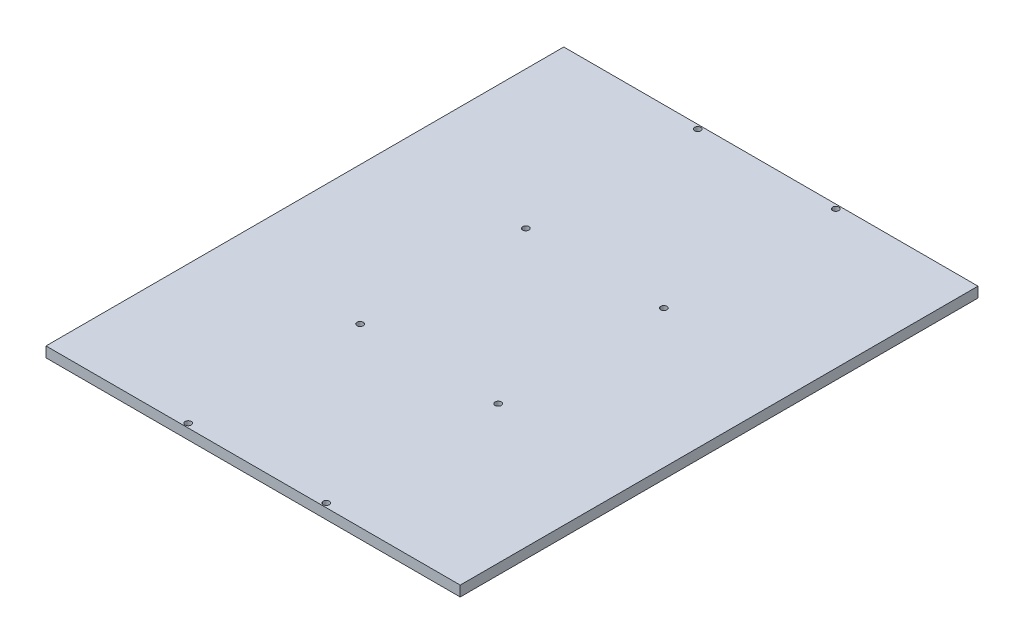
ISO-10303-21;
HEADER;
FILE_DESCRIPTION(('STEP AP214'),'2;1');
FILE_NAME('part.step','',(''),(''),'','','');
FILE_SCHEMA(('AUTOMOTIVE_DESIGN { 1 0 10303 214 1 1 1 1 }'));
ENDSEC;
DATA;
#1=APPLICATION_CONTEXT('core data for automotive mechanical design processes');
#2=APPLICATION_PROTOCOL_DEFINITION('international standard','automotive_design',2000,#1);
#3=PRODUCT_CONTEXT('',#1,'mechanical');
#4=PRODUCT('Part','Part','',(#3));
#5=PRODUCT_RELATED_PRODUCT_CATEGORY('part','',(#4));
#6=PRODUCT_DEFINITION_FORMATION('','',#4);
#7=PRODUCT_DEFINITION_CONTEXT('part definition',#1,'design');
#8=PRODUCT_DEFINITION('design','',#6,#7);
#9=PRODUCT_DEFINITION_SHAPE('','',#8);
#10=(LENGTH_UNIT() NAMED_UNIT(*) SI_UNIT(.MILLI.,.METRE.));
#11=(NAMED_UNIT(*) PLANE_ANGLE_UNIT() SI_UNIT($,.RADIAN.));
#12=(NAMED_UNIT(*) SI_UNIT($,.STERADIAN.) SOLID_ANGLE_UNIT());
#13=UNCERTAINTY_MEASURE_WITH_UNIT(LENGTH_MEASURE(1.E-05),#10,'distance_accuracy_value','');
#14=(GEOMETRIC_REPRESENTATION_CONTEXT(3) GLOBAL_UNCERTAINTY_ASSIGNED_CONTEXT((#13)) GLOBAL_UNIT_ASSIGNED_CONTEXT((#10,
#11,#12)) REPRESENTATION_CONTEXT('',''));
#15=CARTESIAN_POINT('',(0.,0.,0.));
#16=DIRECTION('',(0.,0.,1.));
#17=DIRECTION('',(1.,0.,0.));
#18=AXIS2_PLACEMENT_3D('',#15,#16,#17);
#19=CARTESIAN_POINT('',(0.,5.,0.));
#20=DIRECTION('',(0.,1.,0.));
#21=DIRECTION('',(0.,0.,1.));
#22=AXIS2_PLACEMENT_3D('',#19,#20,#21);
#23=PLANE('',#22);
#24=CARTESIAN_POINT('',(33.3333333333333,5.,-40.));
#25=DIRECTION('',(0.,1.,0.));
#26=DIRECTION('',(0.,0.,1.));
#27=AXIS2_PLACEMENT_3D('',#24,#25,#26);
#28=CIRCLE('',#27,1.49999999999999);
#29=CARTESIAN_POINT('',(33.3333333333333,5.,-38.5));
#30=VERTEX_POINT('',#29);
#31=EDGE_CURVE('E111',#30,#30,#28,.F.);
#32=ORIENTED_EDGE('',*,*,#31,.T.);
#33=EDGE_LOOP('',(#32));
#34=FACE_BOUND('',#33,.T.);
#35=CARTESIAN_POINT('',(-33.3333333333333,5.,-123.));
#36=DIRECTION('',(0.,1.,0.));
#37=DIRECTION('',(0.,0.,1.));
#38=AXIS2_PLACEMENT_3D('',#35,#36,#37);
#39=CIRCLE('',#38,1.5);
#40=CARTESIAN_POINT('',(-33.3333333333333,5.,-121.5));
#41=VERTEX_POINT('',#40);
#42=EDGE_CURVE('E117',#41,#41,#39,.F.);
#43=ORIENTED_EDGE('',*,*,#42,.T.);
#44=EDGE_LOOP('',(#43));
#45=FACE_BOUND('',#44,.T.);
#46=CARTESIAN_POINT('',(33.3333333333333,5.,123.));
#47=DIRECTION('',(0.,1.,0.));
#48=DIRECTION('',(0.,0.,1.));
#49=AXIS2_PLACEMENT_3D('',#46,#47,#48);
#50=CIRCLE('',#49,1.5);
#51=CARTESIAN_POINT('',(33.3333333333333,5.,124.5));
#52=VERTEX_POINT('',#51);
#53=EDGE_CURVE('E28',#52,#52,#50,.F.);
#54=ORIENTED_EDGE('',*,*,#53,.T.);
#55=EDGE_LOOP('',(#54));
#56=FACE_BOUND('',#55,.T.);
#57=DIRECTION('',(0.,0.,-1.));
#58=VECTOR('',#57,1.);
#59=CARTESIAN_POINT('',(-100.,5.,-125.));
#60=LINE('',#59,#58);
#61=CARTESIAN_POINT('',(-100.,5.,-125.));
#62=VERTEX_POINT('',#61);
#63=CARTESIAN_POINT('',(-100.,5.,125.));
#64=VERTEX_POINT('',#63);
#65=EDGE_CURVE('E64',#62,#64,#60,.F.);
#66=ORIENTED_EDGE('',*,*,#65,.T.);
#67=DIRECTION('',(-1.,0.,0.));
#68=VECTOR('',#67,1.);
#69=CARTESIAN_POINT('',(-100.,5.,125.));
#70=LINE('',#69,#68);
#71=CARTESIAN_POINT('',(100.,5.,125.));
#72=VERTEX_POINT('',#71);
#73=EDGE_CURVE('E230',#64,#72,#70,.F.);
#74=ORIENTED_EDGE('',*,*,#73,.T.);
#75=DIRECTION('',(0.,0.,1.));
#76=VECTOR('',#75,1.);
#77=CARTESIAN_POINT('',(100.,5.,-125.));
#78=LINE('',#77,#76);
#79=CARTESIAN_POINT('',(100.,5.,-125.));
#80=VERTEX_POINT('',#79);
#81=EDGE_CURVE('E69',#72,#80,#78,.F.);
#82=ORIENTED_EDGE('',*,*,#81,.T.);
#83=DIRECTION('',(1.,0.,0.));
#84=VECTOR('',#83,1.);
#85=CARTESIAN_POINT('',(-100.,5.,-125.));
#86=LINE('',#85,#84);
#87=EDGE_CURVE('E67',#80,#62,#86,.F.);
#88=ORIENTED_EDGE('',*,*,#87,.T.);
#89=EDGE_LOOP('',(#66,#74,#82,#88));
#90=FACE_BOUND('',#89,.T.);
#91=CARTESIAN_POINT('',(-33.3333333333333,5.,123.));
#92=DIRECTION('',(0.,1.,0.));
#93=DIRECTION('',(0.,0.,1.));
#94=AXIS2_PLACEMENT_3D('',#91,#92,#93);
#95=CIRCLE('',#94,1.5);
#96=CARTESIAN_POINT('',(-33.3333333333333,5.,124.5));
#97=VERTEX_POINT('',#96);
#98=EDGE_CURVE('E75',#97,#97,#95,.F.);
#99=ORIENTED_EDGE('',*,*,#98,.T.);
#100=EDGE_LOOP('',(#99));
#101=FACE_BOUND('',#100,.T.);
#102=CARTESIAN_POINT('',(33.3333333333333,5.,40.));
#103=DIRECTION('',(0.,1.,0.));
#104=DIRECTION('',(0.,0.,1.));
#105=AXIS2_PLACEMENT_3D('',#102,#103,#104);
#106=CIRCLE('',#105,1.49999999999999);
#107=CARTESIAN_POINT('',(33.3333333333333,5.,41.5));
#108=VERTEX_POINT('',#107);
#109=EDGE_CURVE('E126',#108,#108,#106,.F.);
#110=ORIENTED_EDGE('',*,*,#109,.T.);
#111=EDGE_LOOP('',(#110));
#112=FACE_BOUND('',#111,.T.);
#113=CARTESIAN_POINT('',(-33.3333333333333,5.,40.));
#114=DIRECTION('',(0.,1.,0.));
#115=DIRECTION('',(0.,0.,1.));
#116=AXIS2_PLACEMENT_3D('',#113,#114,#115);
#117=CIRCLE('',#116,1.5);
#118=CARTESIAN_POINT('',(-33.3333333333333,5.,41.5));
#119=VERTEX_POINT('',#118);
#120=EDGE_CURVE('E128',#119,#119,#117,.F.);
#121=ORIENTED_EDGE('',*,*,#120,.T.);
#122=EDGE_LOOP('',(#121));
#123=FACE_BOUND('',#122,.T.);
#124=CARTESIAN_POINT('',(-33.3333333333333,5.,-40.));
#125=DIRECTION('',(0.,1.,0.));
#126=DIRECTION('',(0.,0.,1.));
#127=AXIS2_PLACEMENT_3D('',#124,#125,#126);
#128=CIRCLE('',#127,1.5);
#129=CARTESIAN_POINT('',(-33.3333333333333,5.,-38.5));
#130=VERTEX_POINT('',#129);
#131=EDGE_CURVE('E120',#130,#130,#128,.F.);
#132=ORIENTED_EDGE('',*,*,#131,.T.);
#133=EDGE_LOOP('',(#132));
#134=FACE_BOUND('',#133,.T.);
#135=CARTESIAN_POINT('',(33.3333333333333,5.,-123.));
#136=DIRECTION('',(0.,1.,0.));
#137=DIRECTION('',(0.,0.,1.));
#138=AXIS2_PLACEMENT_3D('',#135,#136,#137);
#139=CIRCLE('',#138,1.5);
#140=CARTESIAN_POINT('',(33.3333333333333,5.,-121.5));
#141=VERTEX_POINT('',#140);
#142=EDGE_CURVE('E114',#141,#141,#139,.F.);
#143=ORIENTED_EDGE('',*,*,#142,.T.);
#144=EDGE_LOOP('',(#143));
#145=FACE_BOUND('',#144,.T.);
#146=ADVANCED_FACE('F25',(#34,#45,#56,#90,#101,#112,#123,#134,#145),#23,.T.);
#147=CARTESIAN_POINT('',(33.3333333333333,0.,123.));
#148=DIRECTION('',(0.,1.,0.));
#149=DIRECTION('',(0.,0.,1.));
#150=AXIS2_PLACEMENT_3D('',#147,#148,#149);
#151=CYLINDRICAL_SURFACE('',#150,1.5);
#152=CARTESIAN_POINT('',(33.3333333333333,0.,123.));
#153=DIRECTION('',(0.,1.,0.));
#154=DIRECTION('',(0.,0.,1.));
#155=AXIS2_PLACEMENT_3D('',#152,#153,#154);
#156=CIRCLE('',#155,1.5);
#157=CARTESIAN_POINT('',(33.3333333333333,0.,124.5));
#158=VERTEX_POINT('',#157);
#159=EDGE_CURVE('E108',#158,#158,#156,.F.);
#160=ORIENTED_EDGE('',*,*,#159,.T.);
#161=EDGE_LOOP('',(#160));
#162=FACE_BOUND('',#161,.T.);
#163=ORIENTED_EDGE('',*,*,#53,.F.);
#164=EDGE_LOOP('',(#163));
#165=FACE_BOUND('',#164,.T.);
#166=ADVANCED_FACE('F136',(#162,#165),#151,.F.);
#167=CARTESIAN_POINT('',(-33.3333333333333,0.,40.));
#168=DIRECTION('',(0.,1.,0.));
#169=DIRECTION('',(0.,0.,1.));
#170=AXIS2_PLACEMENT_3D('',#167,#168,#169);
#171=CYLINDRICAL_SURFACE('',#170,1.5);
#172=CARTESIAN_POINT('',(-33.3333333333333,0.,40.));
#173=DIRECTION('',(0.,1.,0.));
#174=DIRECTION('',(0.,0.,1.));
#175=AXIS2_PLACEMENT_3D('',#172,#173,#174);
#176=CIRCLE('',#175,1.5);
#177=CARTESIAN_POINT('',(-33.3333333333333,0.,41.5));
#178=VERTEX_POINT('',#177);
#179=EDGE_CURVE('E105',#178,#178,#176,.F.);
#180=ORIENTED_EDGE('',*,*,#179,.T.);
#181=EDGE_LOOP('',(#180));
#182=FACE_BOUND('',#181,.T.);
#183=ORIENTED_EDGE('',*,*,#120,.F.);
#184=EDGE_LOOP('',(#183));
#185=FACE_BOUND('',#184,.T.);
#186=ADVANCED_FACE('F138',(#182,#185),#171,.F.);
#187=CARTESIAN_POINT('',(33.3333333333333,0.,40.));
#188=DIRECTION('',(0.,1.,0.));
#189=DIRECTION('',(0.,0.,1.));
#190=AXIS2_PLACEMENT_3D('',#187,#188,#189);
#191=CYLINDRICAL_SURFACE('',#190,1.49999999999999);
#192=CARTESIAN_POINT('',(33.3333333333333,0.,40.));
#193=DIRECTION('',(0.,1.,0.));
#194=DIRECTION('',(0.,0.,1.));
#195=AXIS2_PLACEMENT_3D('',#192,#193,#194);
#196=CIRCLE('',#195,1.49999999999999);
#197=CARTESIAN_POINT('',(33.3333333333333,0.,41.5));
#198=VERTEX_POINT('',#197);
#199=EDGE_CURVE('E102',#198,#198,#196,.F.);
#200=ORIENTED_EDGE('',*,*,#199,.T.);
#201=EDGE_LOOP('',(#200));
#202=FACE_BOUND('',#201,.T.);
#203=ORIENTED_EDGE('',*,*,#109,.F.);
#204=EDGE_LOOP('',(#203));
#205=FACE_BOUND('',#204,.T.);
#206=ADVANCED_FACE('F145',(#202,#205),#191,.F.);
#207=CARTESIAN_POINT('',(-33.3333333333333,0.,123.));
#208=DIRECTION('',(0.,1.,0.));
#209=DIRECTION('',(0.,0.,1.));
#210=AXIS2_PLACEMENT_3D('',#207,#208,#209);
#211=CYLINDRICAL_SURFACE('',#210,1.5);
#212=CARTESIAN_POINT('',(-33.3333333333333,0.,123.));
#213=DIRECTION('',(0.,1.,0.));
#214=DIRECTION('',(0.,0.,1.));
#215=AXIS2_PLACEMENT_3D('',#212,#213,#214);
#216=CIRCLE('',#215,1.5);
#217=CARTESIAN_POINT('',(-33.3333333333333,0.,124.5));
#218=VERTEX_POINT('',#217);
#219=EDGE_CURVE('E99',#218,#218,#216,.F.);
#220=ORIENTED_EDGE('',*,*,#219,.T.);
#221=EDGE_LOOP('',(#220));
#222=FACE_BOUND('',#221,.T.);
#223=ORIENTED_EDGE('',*,*,#98,.F.);
#224=EDGE_LOOP('',(#223));
#225=FACE_BOUND('',#224,.T.);
#226=ADVANCED_FACE('F185',(#222,#225),#211,.F.);
#227=CARTESIAN_POINT('',(-100.,5.,-125.));
#228=DIRECTION('',(0.,0.,1.));
#229=DIRECTION('',(1.,0.,0.));
#230=AXIS2_PLACEMENT_3D('',#227,#228,#229);
#231=PLANE('',#230);
#232=DIRECTION('',(0.,1.,0.));
#233=VECTOR('',#232,1.);
#234=CARTESIAN_POINT('',(-100.,5.,-125.));
#235=LINE('',#234,#233);
#236=CARTESIAN_POINT('',(-100.,0.,-125.));
#237=VERTEX_POINT('',#236);
#238=EDGE_CURVE('E74',#237,#62,#235,.T.);
#239=ORIENTED_EDGE('',*,*,#238,.T.);
#240=ORIENTED_EDGE('',*,*,#87,.F.);
#241=DIRECTION('',(0.,1.,0.));
#242=VECTOR('',#241,1.);
#243=CARTESIAN_POINT('',(100.,5.,-125.));
#244=LINE('',#243,#242);
#245=CARTESIAN_POINT('',(100.,0.,-125.));
#246=VERTEX_POINT('',#245);
#247=EDGE_CURVE('E123',#80,#246,#244,.F.);
#248=ORIENTED_EDGE('',*,*,#247,.T.);
#249=DIRECTION('',(1.,0.,0.));
#250=VECTOR('',#249,1.);
#251=CARTESIAN_POINT('',(0.,0.,-125.));
#252=LINE('',#251,#250);
#253=EDGE_CURVE('E86',#246,#237,#252,.F.);
#254=ORIENTED_EDGE('',*,*,#253,.T.);
#255=EDGE_LOOP('',(#239,#240,#248,#254));
#256=FACE_BOUND('',#255,.T.);
#257=ADVANCED_FACE('F85',(#256),#231,.F.);
#258=CARTESIAN_POINT('',(-100.,5.,-125.));
#259=DIRECTION('',(1.,0.,0.));
#260=DIRECTION('',(0.,0.,-1.));
#261=AXIS2_PLACEMENT_3D('',#258,#259,#260);
#262=PLANE('',#261);
#263=DIRECTION('',(0.,1.,0.));
#264=VECTOR('',#263,1.);
#265=CARTESIAN_POINT('',(-100.,5.,125.));
#266=LINE('',#265,#264);
#267=CARTESIAN_POINT('',(-100.,0.,125.));
#268=VERTEX_POINT('',#267);
#269=EDGE_CURVE('E82',#268,#64,#266,.T.);
#270=ORIENTED_EDGE('',*,*,#269,.T.);
#271=ORIENTED_EDGE('',*,*,#65,.F.);
#272=ORIENTED_EDGE('',*,*,#238,.F.);
#273=DIRECTION('',(0.,0.,1.));
#274=VECTOR('',#273,1.);
#275=CARTESIAN_POINT('',(-100.,0.,0.));
#276=LINE('',#275,#274);
#277=EDGE_CURVE('E221',#237,#268,#276,.T.);
#278=ORIENTED_EDGE('',*,*,#277,.T.);
#279=EDGE_LOOP('',(#270,#271,#272,#278));
#280=FACE_BOUND('',#279,.T.);
#281=ADVANCED_FACE('F79',(#280),#262,.F.);
#282=CARTESIAN_POINT('',(-100.,5.,125.));
#283=DIRECTION('',(0.,0.,-1.));
#284=DIRECTION('',(-1.,0.,0.));
#285=AXIS2_PLACEMENT_3D('',#282,#283,#284);
#286=PLANE('',#285);
#287=DIRECTION('',(0.,1.,0.));
#288=VECTOR('',#287,1.);
#289=CARTESIAN_POINT('',(100.,5.,125.));
#290=LINE('',#289,#288);
#291=CARTESIAN_POINT('',(100.,0.,125.));
#292=VERTEX_POINT('',#291);
#293=EDGE_CURVE('E43',#292,#72,#290,.T.);
#294=ORIENTED_EDGE('',*,*,#293,.T.);
#295=ORIENTED_EDGE('',*,*,#73,.F.);
#296=ORIENTED_EDGE('',*,*,#269,.F.);
#297=DIRECTION('',(1.,0.,0.));
#298=VECTOR('',#297,1.);
#299=CARTESIAN_POINT('',(0.,0.,125.));
#300=LINE('',#299,#298);
#301=EDGE_CURVE('E211',#268,#292,#300,.T.);
#302=ORIENTED_EDGE('',*,*,#301,.T.);
#303=EDGE_LOOP('',(#294,#295,#296,#302));
#304=FACE_BOUND('',#303,.T.);
#305=ADVANCED_FACE('F177',(#304),#286,.F.);
#306=CARTESIAN_POINT('',(100.,5.,-125.));
#307=DIRECTION('',(-1.,0.,0.));
#308=DIRECTION('',(0.,0.,1.));
#309=AXIS2_PLACEMENT_3D('',#306,#307,#308);
#310=PLANE('',#309);
#311=ORIENTED_EDGE('',*,*,#247,.F.);
#312=ORIENTED_EDGE('',*,*,#81,.F.);
#313=ORIENTED_EDGE('',*,*,#293,.F.);
#314=DIRECTION('',(0.,0.,1.));
#315=VECTOR('',#314,1.);
#316=CARTESIAN_POINT('',(100.,0.,0.));
#317=LINE('',#316,#315);
#318=EDGE_CURVE('E98',#292,#246,#317,.F.);
#319=ORIENTED_EDGE('',*,*,#318,.T.);
#320=EDGE_LOOP('',(#311,#312,#313,#319));
#321=FACE_BOUND('',#320,.T.);
#322=ADVANCED_FACE('F173',(#321),#310,.F.);
#323=CARTESIAN_POINT('',(-33.3333333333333,0.,-40.));
#324=DIRECTION('',(0.,1.,0.));
#325=DIRECTION('',(0.,0.,1.));
#326=AXIS2_PLACEMENT_3D('',#323,#324,#325);
#327=CYLINDRICAL_SURFACE('',#326,1.5);
#328=ORIENTED_EDGE('',*,*,#131,.F.);
#329=EDGE_LOOP('',(#328));
#330=FACE_BOUND('',#329,.T.);
#331=CARTESIAN_POINT('',(-33.3333333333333,0.,-40.));
#332=DIRECTION('',(0.,1.,0.));
#333=DIRECTION('',(0.,0.,1.));
#334=AXIS2_PLACEMENT_3D('',#331,#332,#333);
#335=CIRCLE('',#334,1.5);
#336=CARTESIAN_POINT('',(-33.3333333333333,0.,-38.5));
#337=VERTEX_POINT('',#336);
#338=EDGE_CURVE('E95',#337,#337,#335,.F.);
#339=ORIENTED_EDGE('',*,*,#338,.T.);
#340=EDGE_LOOP('',(#339));
#341=FACE_BOUND('',#340,.T.);
#342=ADVANCED_FACE('F169',(#330,#341),#327,.F.);
#343=CARTESIAN_POINT('',(-33.3333333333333,0.,-123.));
#344=DIRECTION('',(0.,1.,0.));
#345=DIRECTION('',(0.,0.,1.));
#346=AXIS2_PLACEMENT_3D('',#343,#344,#345);
#347=CYLINDRICAL_SURFACE('',#346,1.5);
#348=ORIENTED_EDGE('',*,*,#42,.F.);
#349=EDGE_LOOP('',(#348));
#350=FACE_BOUND('',#349,.T.);
#351=CARTESIAN_POINT('',(-33.3333333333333,0.,-123.));
#352=DIRECTION('',(0.,1.,0.));
#353=DIRECTION('',(0.,0.,1.));
#354=AXIS2_PLACEMENT_3D('',#351,#352,#353);
#355=CIRCLE('',#354,1.5);
#356=CARTESIAN_POINT('',(-33.3333333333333,0.,-121.5));
#357=VERTEX_POINT('',#356);
#358=EDGE_CURVE('E92',#357,#357,#355,.F.);
#359=ORIENTED_EDGE('',*,*,#358,.T.);
#360=EDGE_LOOP('',(#359));
#361=FACE_BOUND('',#360,.T.);
#362=ADVANCED_FACE('F165',(#350,#361),#347,.F.);
#363=CARTESIAN_POINT('',(33.3333333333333,0.,-123.));
#364=DIRECTION('',(0.,1.,0.));
#365=DIRECTION('',(0.,0.,1.));
#366=AXIS2_PLACEMENT_3D('',#363,#364,#365);
#367=CYLINDRICAL_SURFACE('',#366,1.5);
#368=ORIENTED_EDGE('',*,*,#142,.F.);
#369=EDGE_LOOP('',(#368));
#370=FACE_BOUND('',#369,.T.);
#371=CARTESIAN_POINT('',(33.3333333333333,0.,-123.));
#372=DIRECTION('',(0.,1.,0.));
#373=DIRECTION('',(0.,0.,1.));
#374=AXIS2_PLACEMENT_3D('',#371,#372,#373);
#375=CIRCLE('',#374,1.5);
#376=CARTESIAN_POINT('',(33.3333333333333,0.,-121.5));
#377=VERTEX_POINT('',#376);
#378=EDGE_CURVE('E34',#377,#377,#375,.F.);
#379=ORIENTED_EDGE('',*,*,#378,.T.);
#380=EDGE_LOOP('',(#379));
#381=FACE_BOUND('',#380,.T.);
#382=ADVANCED_FACE('F157',(#370,#381),#367,.F.);
#383=CARTESIAN_POINT('',(33.3333333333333,0.,-40.));
#384=DIRECTION('',(0.,1.,0.));
#385=DIRECTION('',(0.,0.,1.));
#386=AXIS2_PLACEMENT_3D('',#383,#384,#385);
#387=CYLINDRICAL_SURFACE('',#386,1.49999999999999);
#388=ORIENTED_EDGE('',*,*,#31,.F.);
#389=EDGE_LOOP('',(#388));
#390=FACE_BOUND('',#389,.T.);
#391=CARTESIAN_POINT('',(33.3333333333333,0.,-40.));
#392=DIRECTION('',(0.,1.,0.));
#393=DIRECTION('',(0.,0.,1.));
#394=AXIS2_PLACEMENT_3D('',#391,#392,#393);
#395=CIRCLE('',#394,1.49999999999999);
#396=CARTESIAN_POINT('',(33.3333333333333,0.,-38.5));
#397=VERTEX_POINT('',#396);
#398=EDGE_CURVE('E13',#397,#397,#395,.F.);
#399=ORIENTED_EDGE('',*,*,#398,.T.);
#400=EDGE_LOOP('',(#399));
#401=FACE_BOUND('',#400,.T.);
#402=ADVANCED_FACE('F151',(#390,#401),#387,.F.);
#403=CARTESIAN_POINT('',(0.,0.,0.));
#404=DIRECTION('',(0.,1.,0.));
#405=DIRECTION('',(0.,0.,1.));
#406=AXIS2_PLACEMENT_3D('',#403,#404,#405);
#407=PLANE('',#406);
#408=ORIENTED_EDGE('',*,*,#398,.F.);
#409=EDGE_LOOP('',(#408));
#410=FACE_BOUND('',#409,.T.);
#411=ORIENTED_EDGE('',*,*,#378,.F.);
#412=EDGE_LOOP('',(#411));
#413=FACE_BOUND('',#412,.T.);
#414=ORIENTED_EDGE('',*,*,#358,.F.);
#415=EDGE_LOOP('',(#414));
#416=FACE_BOUND('',#415,.T.);
#417=ORIENTED_EDGE('',*,*,#338,.F.);
#418=EDGE_LOOP('',(#417));
#419=FACE_BOUND('',#418,.T.);
#420=ORIENTED_EDGE('',*,*,#301,.F.);
#421=ORIENTED_EDGE('',*,*,#277,.F.);
#422=ORIENTED_EDGE('',*,*,#253,.F.);
#423=ORIENTED_EDGE('',*,*,#318,.F.);
#424=EDGE_LOOP('',(#420,#421,#422,#423));
#425=FACE_BOUND('',#424,.T.);
#426=ORIENTED_EDGE('',*,*,#219,.F.);
#427=EDGE_LOOP('',(#426));
#428=FACE_BOUND('',#427,.T.);
#429=ORIENTED_EDGE('',*,*,#199,.F.);
#430=EDGE_LOOP('',(#429));
#431=FACE_BOUND('',#430,.T.);
#432=ORIENTED_EDGE('',*,*,#179,.F.);
#433=EDGE_LOOP('',(#432));
#434=FACE_BOUND('',#433,.T.);
#435=ORIENTED_EDGE('',*,*,#159,.F.);
#436=EDGE_LOOP('',(#435));
#437=FACE_BOUND('',#436,.T.);
#438=ADVANCED_FACE('F149',(#410,#413,#416,#419,#425,#428,#431,#434,#437),#407,.F.);
#439=CLOSED_SHELL('',(#146,#166,#186,#206,#226,#257,#281,#305,#322,#342,#362,#382,#402,#438));
#440=MANIFOLD_SOLID_BREP('B1',#439);
#441=ADVANCED_BREP_SHAPE_REPRESENTATION('',(#18,#440),#14);
#442=SHAPE_DEFINITION_REPRESENTATION(#9,#441);
ENDSEC;
END-ISO-10303-21;
